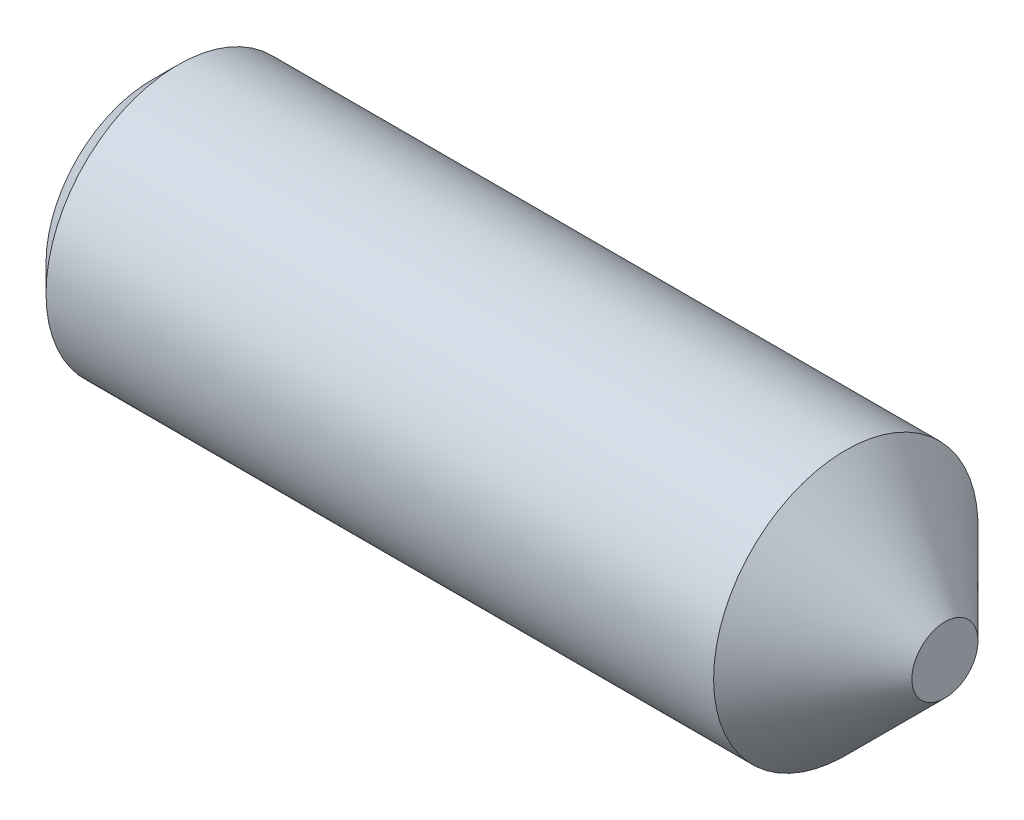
ISO-10303-21;
HEADER;
FILE_DESCRIPTION(('STEP AP214'),'2;1');
FILE_NAME('part.step','',(''),(''),'','','');
FILE_SCHEMA(('AUTOMOTIVE_DESIGN { 1 0 10303 214 1 1 1 1 }'));
ENDSEC;
DATA;
#1=APPLICATION_CONTEXT('core data for automotive mechanical design processes');
#2=APPLICATION_PROTOCOL_DEFINITION('international standard','automotive_design',2000,#1);
#3=PRODUCT_CONTEXT('',#1,'mechanical');
#4=PRODUCT('Part','Part','',(#3));
#5=PRODUCT_RELATED_PRODUCT_CATEGORY('part','',(#4));
#6=PRODUCT_DEFINITION_FORMATION('','',#4);
#7=PRODUCT_DEFINITION_CONTEXT('part definition',#1,'design');
#8=PRODUCT_DEFINITION('design','',#6,#7);
#9=PRODUCT_DEFINITION_SHAPE('','',#8);
#10=(LENGTH_UNIT() NAMED_UNIT(*) SI_UNIT(.MILLI.,.METRE.));
#11=(NAMED_UNIT(*) PLANE_ANGLE_UNIT() SI_UNIT($,.RADIAN.));
#12=(NAMED_UNIT(*) SI_UNIT($,.STERADIAN.) SOLID_ANGLE_UNIT());
#13=UNCERTAINTY_MEASURE_WITH_UNIT(LENGTH_MEASURE(1.E-05),#10,'distance_accuracy_value','');
#14=(GEOMETRIC_REPRESENTATION_CONTEXT(3) GLOBAL_UNCERTAINTY_ASSIGNED_CONTEXT((#13)) GLOBAL_UNIT_ASSIGNED_CONTEXT((#10,
#11,#12)) REPRESENTATION_CONTEXT('',''));
#15=CARTESIAN_POINT('',(0.,0.,0.));
#16=DIRECTION('',(0.,0.,1.));
#17=DIRECTION('',(1.,0.,0.));
#18=AXIS2_PLACEMENT_3D('',#15,#16,#17);
#19=CARTESIAN_POINT('',(-21.25,4.,0.));
#20=DIRECTION('',(1.,0.,0.));
#21=DIRECTION('',(0.,0.,-1.));
#22=AXIS2_PLACEMENT_3D('',#19,#20,#21);
#23=PLANE('',#22);
#24=DIRECTION('',(0.,0.866025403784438,-0.5));
#25=VECTOR('',#24,1.);
#26=CARTESIAN_POINT('',(-21.25,0.,2.88675134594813));
#27=LINE('',#26,#25);
#28=CARTESIAN_POINT('',(-21.25,0.,2.88675134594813));
#29=VERTEX_POINT('',#28);
#30=CARTESIAN_POINT('',(-21.25,2.5,1.44337567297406));
#31=VERTEX_POINT('',#30);
#32=EDGE_CURVE('E105',#29,#31,#27,.T.);
#33=ORIENTED_EDGE('',*,*,#32,.F.);
#34=DIRECTION('',(0.,0.866025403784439,0.5));
#35=VECTOR('',#34,1.);
#36=CARTESIAN_POINT('',(-21.25,-2.5,1.44337567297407));
#37=LINE('',#36,#35);
#38=CARTESIAN_POINT('',(-21.25,-2.5,1.44337567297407));
#39=VERTEX_POINT('',#38);
#40=EDGE_CURVE('E51',#39,#29,#37,.T.);
#41=ORIENTED_EDGE('',*,*,#40,.F.);
#42=DIRECTION('',(0.,0.,1.));
#43=VECTOR('',#42,1.);
#44=CARTESIAN_POINT('',(-21.25,-2.5,-1.44337567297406));
#45=LINE('',#44,#43);
#46=CARTESIAN_POINT('',(-21.25,-2.5,-1.44337567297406));
#47=VERTEX_POINT('',#46);
#48=EDGE_CURVE('E120',#47,#39,#45,.T.);
#49=ORIENTED_EDGE('',*,*,#48,.F.);
#50=DIRECTION('',(0.,-0.866025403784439,0.5));
#51=VECTOR('',#50,1.);
#52=CARTESIAN_POINT('',(-21.25,0.,-2.88675134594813));
#53=LINE('',#52,#51);
#54=CARTESIAN_POINT('',(-21.25,0.,-2.88675134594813));
#55=VERTEX_POINT('',#54);
#56=EDGE_CURVE('E114',#55,#47,#53,.T.);
#57=ORIENTED_EDGE('',*,*,#56,.F.);
#58=DIRECTION('',(0.,-0.866025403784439,-0.5));
#59=VECTOR('',#58,1.);
#60=CARTESIAN_POINT('',(-21.25,2.5,-1.44337567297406));
#61=LINE('',#60,#59);
#62=CARTESIAN_POINT('',(-21.25,2.5,-1.44337567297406));
#63=VERTEX_POINT('',#62);
#64=EDGE_CURVE('E112',#63,#55,#61,.T.);
#65=ORIENTED_EDGE('',*,*,#64,.F.);
#66=DIRECTION('',(0.,0.,-1.));
#67=VECTOR('',#66,1.);
#68=CARTESIAN_POINT('',(-21.25,2.5,1.44337567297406));
#69=LINE('',#68,#67);
#70=EDGE_CURVE('E94',#31,#63,#69,.T.);
#71=ORIENTED_EDGE('',*,*,#70,.F.);
#72=EDGE_LOOP('',(#33,#41,#49,#57,#65,#71));
#73=FACE_BOUND('',#72,.T.);
#74=CARTESIAN_POINT('',(-21.25,0.,0.));
#75=DIRECTION('',(-1.,0.,0.));
#76=DIRECTION('',(0.,0.,1.));
#77=AXIS2_PLACEMENT_3D('',#74,#75,#76);
#78=CIRCLE('',#77,4.);
#79=CARTESIAN_POINT('',(-21.25,0.,4.));
#80=VERTEX_POINT('',#79);
#81=EDGE_CURVE('E138',#80,#80,#78,.T.);
#82=ORIENTED_EDGE('',*,*,#81,.T.);
#83=EDGE_LOOP('',(#82));
#84=FACE_BOUND('',#83,.T.);
#85=ADVANCED_FACE('F37',(#73,#84),#23,.F.);
#86=CARTESIAN_POINT('',(8.74999999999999,1.25,0.));
#87=DIRECTION('',(-1.,0.,0.));
#88=DIRECTION('',(0.,0.,1.));
#89=AXIS2_PLACEMENT_3D('',#86,#87,#88);
#90=PLANE('',#89);
#91=CARTESIAN_POINT('',(8.74999999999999,0.,0.));
#92=DIRECTION('',(-1.,0.,0.));
#93=DIRECTION('',(0.,0.,1.));
#94=AXIS2_PLACEMENT_3D('',#91,#92,#93);
#95=CIRCLE('',#94,1.25);
#96=CARTESIAN_POINT('',(8.74999999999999,0.,1.25));
#97=VERTEX_POINT('',#96);
#98=EDGE_CURVE('E11',#97,#97,#95,.T.);
#99=ORIENTED_EDGE('',*,*,#98,.F.);
#100=EDGE_LOOP('',(#99));
#101=FACE_BOUND('',#100,.T.);
#102=ADVANCED_FACE('F157',(#101),#90,.F.);
#103=CARTESIAN_POINT('',(8.74999999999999,0.,0.));
#104=DIRECTION('',(-1.,0.,0.));
#105=DIRECTION('',(0.,0.,1.));
#106=AXIS2_PLACEMENT_3D('',#103,#104,#105);
#107=CONICAL_SURFACE('',#106,1.25,0.785398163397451);
#108=CARTESIAN_POINT('',(5.,0.,0.));
#109=DIRECTION('',(-1.,0.,0.));
#110=DIRECTION('',(0.,0.,1.));
#111=AXIS2_PLACEMENT_3D('',#108,#109,#110);
#112=CIRCLE('',#111,5.);
#113=CARTESIAN_POINT('',(5.00000000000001,0.,5.));
#114=VERTEX_POINT('',#113);
#115=EDGE_CURVE('E44',#114,#114,#112,.T.);
#116=CARTESIAN_POINT('',(5.00000000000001,0.,5.));
#117=CARTESIAN_POINT('',(5.0390625,0.,4.9609375));
#118=CARTESIAN_POINT('',(5.078125,0.,4.921875));
#119=CARTESIAN_POINT('',(5.15625,0.,4.84375));
#120=CARTESIAN_POINT('',(5.1953125,0.,4.8046875));
#121=CARTESIAN_POINT('',(5.2734375,0.,4.7265625));
#122=CARTESIAN_POINT('',(5.3125,0.,4.6875));
#123=CARTESIAN_POINT('',(5.390625,0.,4.609375));
#124=CARTESIAN_POINT('',(5.4296875,0.,4.5703125));
#125=CARTESIAN_POINT('',(5.5078125,0.,4.4921875));
#126=CARTESIAN_POINT('',(5.546875,0.,4.453125));
#127=CARTESIAN_POINT('',(5.625,0.,4.375));
#128=CARTESIAN_POINT('',(5.6640625,0.,4.3359375));
#129=CARTESIAN_POINT('',(5.7421875,0.,4.2578125));
#130=CARTESIAN_POINT('',(5.78125,0.,4.21875));
#131=CARTESIAN_POINT('',(5.859375,0.,4.140625));
#132=CARTESIAN_POINT('',(5.8984375,0.,4.1015625));
#133=CARTESIAN_POINT('',(5.9765625,0.,4.0234375));
#134=CARTESIAN_POINT('',(6.015625,0.,3.984375));
#135=CARTESIAN_POINT('',(6.09375,0.,3.90625));
#136=CARTESIAN_POINT('',(6.1328125,0.,3.8671875));
#137=CARTESIAN_POINT('',(6.2109375,0.,3.7890625));
#138=CARTESIAN_POINT('',(6.25,0.,3.75));
#139=CARTESIAN_POINT('',(6.328125,0.,3.671875));
#140=CARTESIAN_POINT('',(6.3671875,0.,3.6328125));
#141=CARTESIAN_POINT('',(6.4453125,0.,3.5546875));
#142=CARTESIAN_POINT('',(6.484375,0.,3.515625));
#143=CARTESIAN_POINT('',(6.5625,0.,3.4375));
#144=CARTESIAN_POINT('',(6.6015625,0.,3.3984375));
#145=CARTESIAN_POINT('',(6.6796875,0.,3.3203125));
#146=CARTESIAN_POINT('',(6.71875,0.,3.28125));
#147=CARTESIAN_POINT('',(6.796875,0.,3.203125));
#148=CARTESIAN_POINT('',(6.8359375,0.,3.1640625));
#149=CARTESIAN_POINT('',(6.9140625,0.,3.0859375));
#150=CARTESIAN_POINT('',(6.953125,0.,3.046875));
#151=CARTESIAN_POINT('',(7.03125,0.,2.96875));
#152=CARTESIAN_POINT('',(7.0703125,0.,2.9296875));
#153=CARTESIAN_POINT('',(7.1484375,0.,2.8515625));
#154=CARTESIAN_POINT('',(7.18749999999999,0.,2.8125));
#155=CARTESIAN_POINT('',(7.265625,0.,2.734375));
#156=CARTESIAN_POINT('',(7.30468749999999,0.,2.6953125));
#157=CARTESIAN_POINT('',(7.38281249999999,0.,2.6171875));
#158=CARTESIAN_POINT('',(7.42187499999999,0.,2.578125));
#159=CARTESIAN_POINT('',(7.49999999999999,0.,2.5));
#160=CARTESIAN_POINT('',(7.53906249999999,0.,2.4609375));
#161=CARTESIAN_POINT('',(7.61718749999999,0.,2.3828125));
#162=CARTESIAN_POINT('',(7.65624999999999,0.,2.34375));
#163=CARTESIAN_POINT('',(7.73437499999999,0.,2.265625));
#164=CARTESIAN_POINT('',(7.77343749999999,0.,2.2265625));
#165=CARTESIAN_POINT('',(7.85156249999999,0.,2.1484375));
#166=CARTESIAN_POINT('',(7.89062499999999,0.,2.109375));
#167=CARTESIAN_POINT('',(7.96874999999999,0.,2.03125));
#168=CARTESIAN_POINT('',(8.00781249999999,0.,1.9921875));
#169=CARTESIAN_POINT('',(8.08593749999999,0.,1.9140625));
#170=CARTESIAN_POINT('',(8.12499999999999,0.,1.875));
#171=CARTESIAN_POINT('',(8.20312499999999,0.,1.796875));
#172=CARTESIAN_POINT('',(8.24218749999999,0.,1.7578125));
#173=CARTESIAN_POINT('',(8.32031249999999,0.,1.6796875));
#174=CARTESIAN_POINT('',(8.35937499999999,0.,1.640625));
#175=CARTESIAN_POINT('',(8.43749999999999,0.,1.5625));
#176=CARTESIAN_POINT('',(8.47656249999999,0.,1.5234375));
#177=CARTESIAN_POINT('',(8.55468749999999,0.,1.4453125));
#178=CARTESIAN_POINT('',(8.59374999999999,0.,1.40625));
#179=CARTESIAN_POINT('',(8.67187499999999,0.,1.328125));
#180=CARTESIAN_POINT('',(8.71093749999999,0.,1.2890625));
#181=CARTESIAN_POINT('',(8.74999999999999,0.,1.25));
#182=B_SPLINE_CURVE_WITH_KNOTS('',3,(#116,#117,#118,#119,#120,#121,#122,#123,#124,#125,#126,
#127,#128,#129,#130,#131,#132,#133,#134,#135,#136,#137,#138,#139,#140,#141,#142,#143,#144,#145,
#146,#147,#148,#149,#150,#151,#152,#153,#154,#155,#156,#157,#158,#159,#160,#161,#162,#163,#164,
#165,#166,#167,#168,#169,#170,#171,#172,#173,#174,#175,#176,#177,#178,#179,#180,#181),
.UNSPECIFIED.,.F.,.F.,(4,2,2,2,2,2,2,2,2,2,2,2,2,2,2,2,2,2,2,2,2,2,2,2,2,2,2,2,2,2,2,2,4),(0.,
0.165728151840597,0.331456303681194,0.49718445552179,0.662912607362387,0.828640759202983,
0.99436891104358,1.16009706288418,1.32582521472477,1.49155336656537,1.65728151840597,
1.82300967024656,1.98873782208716,2.15446597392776,2.32019412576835,2.48592227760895,
2.65165042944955,2.81737858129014,2.98310673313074,3.14883488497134,3.31456303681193,
3.48029118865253,3.64601934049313,3.81174749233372,3.97747564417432,4.14320379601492,
4.30893194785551,4.47466009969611,4.64038825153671,4.8061164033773,4.9718445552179,
5.1375727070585,5.30330085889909),.UNSPECIFIED.);
#183=EDGE_CURVE('BSEAM154',#114,#97,#182,.T.);
#184=ORIENTED_EDGE('',*,*,#115,.F.);
#185=ORIENTED_EDGE('',*,*,#98,.T.);
#186=ORIENTED_EDGE('',*,*,#183,.T.);
#187=ORIENTED_EDGE('',*,*,#183,.F.);
#188=EDGE_LOOP('',(#184,#186,#185,#187));
#189=FACE_BOUND('',#188,.T.);
#190=ADVANCED_FACE('F154',(#189),#107,.T.);
#191=CARTESIAN_POINT('',(-21.25,0.,0.));
#192=DIRECTION('',(-1.,0.,0.));
#193=DIRECTION('',(0.,0.,1.));
#194=AXIS2_PLACEMENT_3D('',#191,#192,#193);
#195=CYLINDRICAL_SURFACE('',#194,5.);
#196=CARTESIAN_POINT('',(-20.25,0.,0.));
#197=DIRECTION('',(-1.,0.,0.));
#198=DIRECTION('',(0.,0.,1.));
#199=AXIS2_PLACEMENT_3D('',#196,#197,#198);
#200=CIRCLE('',#199,5.);
#201=CARTESIAN_POINT('',(-20.25,0.,5.));
#202=VERTEX_POINT('',#201);
#203=EDGE_CURVE('E147',#202,#202,#200,.T.);
#204=ORIENTED_EDGE('',*,*,#203,.F.);
#205=EDGE_LOOP('',(#204));
#206=FACE_BOUND('',#205,.T.);
#207=ORIENTED_EDGE('',*,*,#115,.T.);
#208=EDGE_LOOP('',(#207));
#209=FACE_BOUND('',#208,.T.);
#210=ADVANCED_FACE('F152',(#206,#209),#195,.T.);
#211=CARTESIAN_POINT('',(-20.25,0.,0.));
#212=DIRECTION('',(1.,0.,0.));
#213=DIRECTION('',(0.,0.,-1.));
#214=AXIS2_PLACEMENT_3D('',#211,#212,#213);
#215=CONICAL_SURFACE('',#214,5.,0.785398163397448);
#216=ORIENTED_EDGE('',*,*,#81,.F.);
#217=EDGE_LOOP('',(#216));
#218=FACE_BOUND('',#217,.T.);
#219=ORIENTED_EDGE('',*,*,#203,.T.);
#220=EDGE_LOOP('',(#219));
#221=FACE_BOUND('',#220,.T.);
#222=ADVANCED_FACE('F168',(#218,#221),#215,.T.);
#223=CARTESIAN_POINT('',(-16.25,-2.5,1.44337567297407));
#224=DIRECTION('',(0.,-0.5,0.866025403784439));
#225=DIRECTION('',(0.,-0.866025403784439,-0.5));
#226=AXIS2_PLACEMENT_3D('',#223,#224,#225);
#227=PLANE('',#226);
#228=ORIENTED_EDGE('',*,*,#40,.T.);
#229=DIRECTION('',(-1.,0.,0.));
#230=VECTOR('',#229,1.);
#231=CARTESIAN_POINT('',(-16.25,0.,2.88675134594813));
#232=LINE('',#231,#230);
#233=CARTESIAN_POINT('',(-16.25,0.,2.88675134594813));
#234=VERTEX_POINT('',#233);
#235=EDGE_CURVE('E102',#234,#29,#232,.T.);
#236=ORIENTED_EDGE('',*,*,#235,.F.);
#237=DIRECTION('',(0.,0.866025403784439,0.5));
#238=VECTOR('',#237,1.);
#239=CARTESIAN_POINT('',(-16.25,-2.5,1.44337567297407));
#240=LINE('',#239,#238);
#241=CARTESIAN_POINT('',(-16.25,-2.5,1.44337567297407));
#242=VERTEX_POINT('',#241);
#243=EDGE_CURVE('E122',#242,#234,#240,.T.);
#244=ORIENTED_EDGE('',*,*,#243,.F.);
#245=DIRECTION('',(-1.,0.,0.));
#246=VECTOR('',#245,1.);
#247=CARTESIAN_POINT('',(-16.25,-2.5,1.44337567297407));
#248=LINE('',#247,#246);
#249=EDGE_CURVE('E58',#242,#39,#248,.T.);
#250=ORIENTED_EDGE('',*,*,#249,.T.);
#251=EDGE_LOOP('',(#228,#236,#244,#250));
#252=FACE_BOUND('',#251,.T.);
#253=ADVANCED_FACE('F172',(#252),#227,.F.);
#254=CARTESIAN_POINT('',(-16.25,-2.5,-1.44337567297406));
#255=DIRECTION('',(0.,-1.,0.));
#256=DIRECTION('',(0.,0.,-1.));
#257=AXIS2_PLACEMENT_3D('',#254,#255,#256);
#258=PLANE('',#257);
#259=ORIENTED_EDGE('',*,*,#48,.T.);
#260=ORIENTED_EDGE('',*,*,#249,.F.);
#261=DIRECTION('',(0.,0.,1.));
#262=VECTOR('',#261,1.);
#263=CARTESIAN_POINT('',(-16.25,-2.5,-1.44337567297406));
#264=LINE('',#263,#262);
#265=CARTESIAN_POINT('',(-16.25,-2.5,-1.44337567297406));
#266=VERTEX_POINT('',#265);
#267=EDGE_CURVE('E134',#266,#242,#264,.T.);
#268=ORIENTED_EDGE('',*,*,#267,.F.);
#269=DIRECTION('',(-1.,0.,0.));
#270=VECTOR('',#269,1.);
#271=CARTESIAN_POINT('',(-16.25,-2.5,-1.44337567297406));
#272=LINE('',#271,#270);
#273=EDGE_CURVE('E139',#266,#47,#272,.T.);
#274=ORIENTED_EDGE('',*,*,#273,.T.);
#275=EDGE_LOOP('',(#259,#260,#268,#274));
#276=FACE_BOUND('',#275,.T.);
#277=ADVANCED_FACE('F176',(#276),#258,.F.);
#278=CARTESIAN_POINT('',(-16.25,0.,-2.88675134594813));
#279=DIRECTION('',(0.,-0.5,-0.866025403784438));
#280=DIRECTION('',(0.,0.866025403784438,-0.5));
#281=AXIS2_PLACEMENT_3D('',#278,#279,#280);
#282=PLANE('',#281);
#283=ORIENTED_EDGE('',*,*,#56,.T.);
#284=ORIENTED_EDGE('',*,*,#273,.F.);
#285=DIRECTION('',(0.,-0.866025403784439,0.5));
#286=VECTOR('',#285,1.);
#287=CARTESIAN_POINT('',(-16.25,0.,-2.88675134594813));
#288=LINE('',#287,#286);
#289=CARTESIAN_POINT('',(-16.25,0.,-2.88675134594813));
#290=VERTEX_POINT('',#289);
#291=EDGE_CURVE('E131',#290,#266,#288,.T.);
#292=ORIENTED_EDGE('',*,*,#291,.F.);
#293=DIRECTION('',(-1.,0.,0.));
#294=VECTOR('',#293,1.);
#295=CARTESIAN_POINT('',(-16.25,0.,-2.88675134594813));
#296=LINE('',#295,#294);
#297=EDGE_CURVE('E141',#290,#55,#296,.T.);
#298=ORIENTED_EDGE('',*,*,#297,.T.);
#299=EDGE_LOOP('',(#283,#284,#292,#298));
#300=FACE_BOUND('',#299,.T.);
#301=ADVANCED_FACE('F185',(#300),#282,.F.);
#302=CARTESIAN_POINT('',(-16.25,2.5,-1.44337567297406));
#303=DIRECTION('',(0.,0.5,-0.866025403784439));
#304=DIRECTION('',(0.,0.866025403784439,0.5));
#305=AXIS2_PLACEMENT_3D('',#302,#303,#304);
#306=PLANE('',#305);
#307=ORIENTED_EDGE('',*,*,#64,.T.);
#308=ORIENTED_EDGE('',*,*,#297,.F.);
#309=DIRECTION('',(0.,-0.866025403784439,-0.5));
#310=VECTOR('',#309,1.);
#311=CARTESIAN_POINT('',(-16.25,2.5,-1.44337567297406));
#312=LINE('',#311,#310);
#313=CARTESIAN_POINT('',(-16.25,2.5,-1.44337567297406));
#314=VERTEX_POINT('',#313);
#315=EDGE_CURVE('E128',#314,#290,#312,.T.);
#316=ORIENTED_EDGE('',*,*,#315,.F.);
#317=DIRECTION('',(-1.,0.,0.));
#318=VECTOR('',#317,1.);
#319=CARTESIAN_POINT('',(-16.25,2.5,-1.44337567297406));
#320=LINE('',#319,#318);
#321=EDGE_CURVE('E101',#314,#63,#320,.T.);
#322=ORIENTED_EDGE('',*,*,#321,.T.);
#323=EDGE_LOOP('',(#307,#308,#316,#322));
#324=FACE_BOUND('',#323,.T.);
#325=ADVANCED_FACE('F182',(#324),#306,.F.);
#326=CARTESIAN_POINT('',(-16.25,2.5,1.44337567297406));
#327=DIRECTION('',(0.,1.,0.));
#328=DIRECTION('',(0.,0.,1.));
#329=AXIS2_PLACEMENT_3D('',#326,#327,#328);
#330=PLANE('',#329);
#331=ORIENTED_EDGE('',*,*,#70,.T.);
#332=ORIENTED_EDGE('',*,*,#321,.F.);
#333=DIRECTION('',(0.,0.,-1.));
#334=VECTOR('',#333,1.);
#335=CARTESIAN_POINT('',(-16.25,2.5,1.44337567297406));
#336=LINE('',#335,#334);
#337=CARTESIAN_POINT('',(-16.25,2.5,1.44337567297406));
#338=VERTEX_POINT('',#337);
#339=EDGE_CURVE('E97',#338,#314,#336,.T.);
#340=ORIENTED_EDGE('',*,*,#339,.F.);
#341=DIRECTION('',(-1.,0.,0.));
#342=VECTOR('',#341,1.);
#343=CARTESIAN_POINT('',(-16.25,2.5,1.44337567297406));
#344=LINE('',#343,#342);
#345=EDGE_CURVE('E90',#338,#31,#344,.T.);
#346=ORIENTED_EDGE('',*,*,#345,.T.);
#347=EDGE_LOOP('',(#331,#332,#340,#346));
#348=FACE_BOUND('',#347,.T.);
#349=ADVANCED_FACE('F92',(#348),#330,.F.);
#350=CARTESIAN_POINT('',(-16.25,0.,2.88675134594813));
#351=DIRECTION('',(0.,0.5,0.866025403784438));
#352=DIRECTION('',(0.,-0.866025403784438,0.5));
#353=AXIS2_PLACEMENT_3D('',#350,#351,#352);
#354=PLANE('',#353);
#355=ORIENTED_EDGE('',*,*,#32,.T.);
#356=ORIENTED_EDGE('',*,*,#345,.F.);
#357=DIRECTION('',(0.,0.866025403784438,-0.5));
#358=VECTOR('',#357,1.);
#359=CARTESIAN_POINT('',(-16.25,0.,2.88675134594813));
#360=LINE('',#359,#358);
#361=EDGE_CURVE('E125',#234,#338,#360,.T.);
#362=ORIENTED_EDGE('',*,*,#361,.F.);
#363=ORIENTED_EDGE('',*,*,#235,.T.);
#364=EDGE_LOOP('',(#355,#356,#362,#363));
#365=FACE_BOUND('',#364,.T.);
#366=ADVANCED_FACE('F106',(#365),#354,.F.);
#367=CARTESIAN_POINT('',(-16.25,0.,2.88675134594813));
#368=DIRECTION('',(-1.,0.,0.));
#369=DIRECTION('',(0.,0.,1.));
#370=AXIS2_PLACEMENT_3D('',#367,#368,#369);
#371=PLANE('',#370);
#372=ORIENTED_EDGE('',*,*,#243,.T.);
#373=ORIENTED_EDGE('',*,*,#361,.T.);
#374=ORIENTED_EDGE('',*,*,#339,.T.);
#375=ORIENTED_EDGE('',*,*,#315,.T.);
#376=ORIENTED_EDGE('',*,*,#291,.T.);
#377=ORIENTED_EDGE('',*,*,#267,.T.);
#378=EDGE_LOOP('',(#372,#373,#374,#375,#376,#377));
#379=FACE_BOUND('',#378,.T.);
#380=ADVANCED_FACE('F179',(#379),#371,.T.);
#381=CLOSED_SHELL('',(#85,#102,#190,#210,#222,#253,#277,#301,#325,#349,#366,#380));
#382=MANIFOLD_SOLID_BREP('B2',#381);
#383=ADVANCED_BREP_SHAPE_REPRESENTATION('',(#18,#382),#14);
#384=SHAPE_DEFINITION_REPRESENTATION(#9,#383);
ENDSEC;
END-ISO-10303-21;
